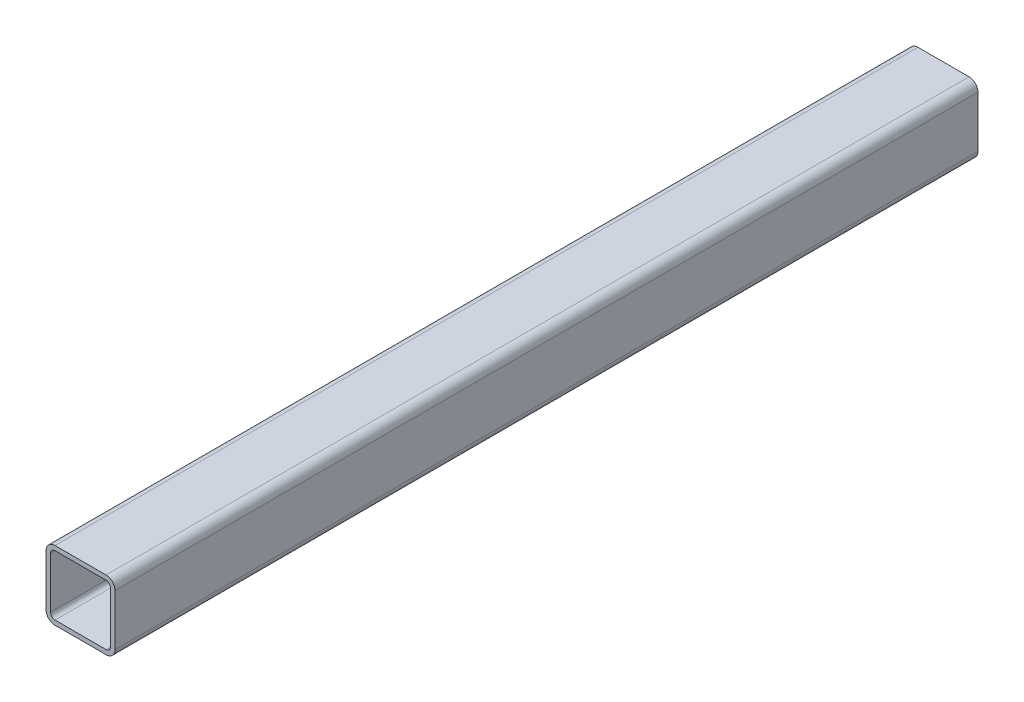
from build123d import *

# Parameters (mm, degrees)
EXTRUIR1_DEPTH = 500


with BuildPart() as part:
    # Croquis1 → Extruir1 (new body)
    with BuildSketch(Plane.XY):
        with BuildLine():
            Line((5.2, 1.15), (34.8, 1.15))
            ThreePointArc((34.8, 1.15), (38.476955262, 2.673044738), (40, 6.35))
            Line((40, 6.35), (40, 35.95))
            ThreePointArc((40, 35.95), (38.476955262, 39.626955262), (34.8, 41.15))
            Line((34.8, 41.15), (5.2, 41.15))
            ThreePointArc((5.2, 41.15), (1.523044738, 39.626955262), (0, 35.95))
            Line((0, 35.95), (0, 6.35))
            ThreePointArc((0, 6.35), (1.523044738, 2.673044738), (5.2, 1.15))
        make_face()
        with BuildLine():
            Line((5.2, 3.75), (34.8, 3.75))
            ThreePointArc((34.8, 3.75), (36.638477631, 4.511522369), (37.4, 6.35))
            Line((37.4, 6.35), (37.4, 35.95))
            ThreePointArc((37.4, 35.95), (36.638477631, 37.788477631), (34.8, 38.55))
            Line((34.8, 38.55), (5.2, 38.55))
            ThreePointArc((5.2, 38.55), (3.361522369, 37.788477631), (2.6, 35.95))
            Line((2.6, 35.95), (2.6, 6.35))
            ThreePointArc((2.6, 6.35), (3.361522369, 4.511522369), (5.2, 3.75))
        make_face(mode=Mode.SUBTRACT)
    extrude(amount=EXTRUIR1_DEPTH)


solid = part.part
